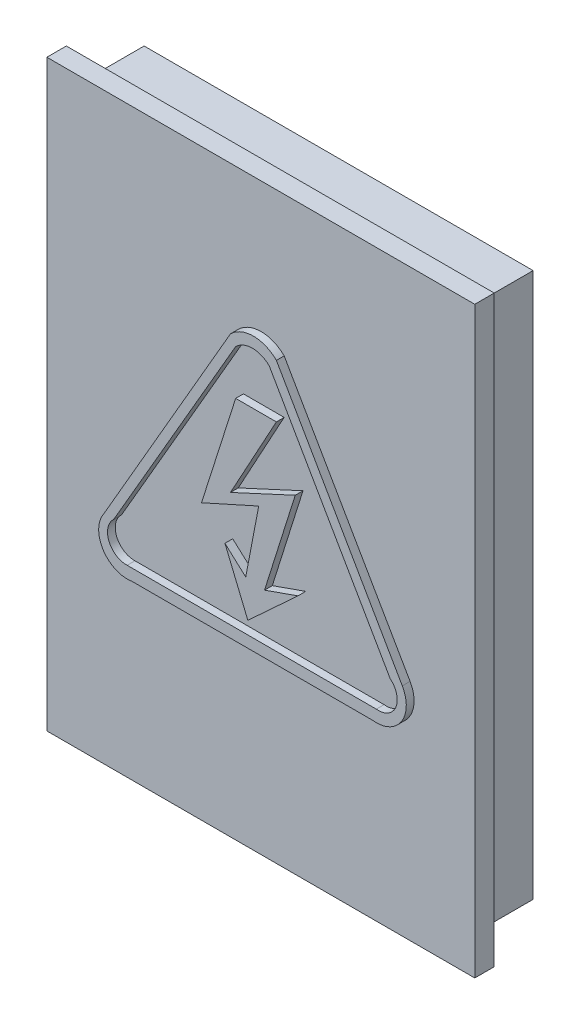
ISO-10303-21;
HEADER;
FILE_DESCRIPTION(('STEP AP214'),'2;1');
FILE_NAME('part.step','',(''),(''),'','','');
FILE_SCHEMA(('AUTOMOTIVE_DESIGN { 1 0 10303 214 1 1 1 1 }'));
ENDSEC;
DATA;
#1=APPLICATION_CONTEXT('core data for automotive mechanical design processes');
#2=APPLICATION_PROTOCOL_DEFINITION('international standard','automotive_design',2000,#1);
#3=PRODUCT_CONTEXT('',#1,'mechanical');
#4=PRODUCT('Part','Part','',(#3));
#5=PRODUCT_RELATED_PRODUCT_CATEGORY('part','',(#4));
#6=PRODUCT_DEFINITION_FORMATION('','',#4);
#7=PRODUCT_DEFINITION_CONTEXT('part definition',#1,'design');
#8=PRODUCT_DEFINITION('design','',#6,#7);
#9=PRODUCT_DEFINITION_SHAPE('','',#8);
#10=(LENGTH_UNIT() NAMED_UNIT(*) SI_UNIT(.MILLI.,.METRE.));
#11=(NAMED_UNIT(*) PLANE_ANGLE_UNIT() SI_UNIT($,.RADIAN.));
#12=(NAMED_UNIT(*) SI_UNIT($,.STERADIAN.) SOLID_ANGLE_UNIT());
#13=UNCERTAINTY_MEASURE_WITH_UNIT(LENGTH_MEASURE(1.E-05),#10,'distance_accuracy_value','');
#14=(GEOMETRIC_REPRESENTATION_CONTEXT(3) GLOBAL_UNCERTAINTY_ASSIGNED_CONTEXT((#13)) GLOBAL_UNIT_ASSIGNED_CONTEXT((#10,
#11,#12)) REPRESENTATION_CONTEXT('',''));
#15=CARTESIAN_POINT('',(0.,0.,0.));
#16=DIRECTION('',(0.,0.,1.));
#17=DIRECTION('',(1.,0.,0.));
#18=AXIS2_PLACEMENT_3D('',#15,#16,#17);
#19=CARTESIAN_POINT('',(0.,0.,20.));
#20=DIRECTION('',(0.,0.,1.));
#21=DIRECTION('',(1.,0.,0.));
#22=AXIS2_PLACEMENT_3D('',#19,#20,#21);
#23=PLANE('',#22);
#24=DIRECTION('',(0.,1.,0.));
#25=VECTOR('',#24,1.);
#26=CARTESIAN_POINT('',(55.,75.,20.));
#27=LINE('',#26,#25);
#28=CARTESIAN_POINT('',(55.,-75.,20.));
#29=VERTEX_POINT('',#28);
#30=CARTESIAN_POINT('',(55.,75.,20.));
#31=VERTEX_POINT('',#30);
#32=EDGE_CURVE('E487',#29,#31,#27,.T.);
#33=ORIENTED_EDGE('',*,*,#32,.T.);
#34=DIRECTION('',(-1.,0.,0.));
#35=VECTOR('',#34,1.);
#36=CARTESIAN_POINT('',(-55.,75.,20.));
#37=LINE('',#36,#35);
#38=CARTESIAN_POINT('',(-55.,75.,20.));
#39=VERTEX_POINT('',#38);
#40=EDGE_CURVE('E490',#31,#39,#37,.T.);
#41=ORIENTED_EDGE('',*,*,#40,.T.);
#42=DIRECTION('',(0.,-1.,0.));
#43=VECTOR('',#42,1.);
#44=CARTESIAN_POINT('',(-55.,75.,20.));
#45=LINE('',#44,#43);
#46=CARTESIAN_POINT('',(-55.,-75.,20.));
#47=VERTEX_POINT('',#46);
#48=EDGE_CURVE('E493',#39,#47,#45,.T.);
#49=ORIENTED_EDGE('',*,*,#48,.T.);
#50=DIRECTION('',(1.,0.,0.));
#51=VECTOR('',#50,1.);
#52=CARTESIAN_POINT('',(-55.,-75.,20.));
#53=LINE('',#52,#51);
#54=EDGE_CURVE('E495',#47,#29,#53,.T.);
#55=ORIENTED_EDGE('',*,*,#54,.T.);
#56=EDGE_LOOP('',(#33,#41,#49,#55));
#57=FACE_BOUND('',#56,.T.);
#58=CARTESIAN_POINT('',(0.0994994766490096,33.1119752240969,20.));
#59=DIRECTION('',(0.,0.,1.));
#60=DIRECTION('',(1.,0.,0.));
#61=AXIS2_PLACEMENT_3D('',#58,#59,#60);
#62=CIRCLE('',#61,8.34537360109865);
#63=CARTESIAN_POINT('',(-5.80157297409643,39.0130433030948,20.));
#64=VERTEX_POINT('',#63);
#65=CARTESIAN_POINT('',(6.00056755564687,39.0130476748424,20.));
#66=VERTEX_POINT('',#65);
#67=EDGE_CURVE('E301',#64,#66,#62,.F.);
#68=ORIENTED_EDGE('',*,*,#67,.T.);
#69=DIRECTION('',(0.498504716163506,-0.866886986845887,0.));
#70=VECTOR('',#69,1.);
#71=CARTESIAN_POINT('',(21.3687661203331,12.2881423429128,20.));
#72=LINE('',#71,#70);
#73=CARTESIAN_POINT('',(38.3710118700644,-17.2783293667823,20.));
#74=VERTEX_POINT('',#73);
#75=EDGE_CURVE('E353',#66,#74,#72,.T.);
#76=ORIENTED_EDGE('',*,*,#75,.T.);
#77=CARTESIAN_POINT('',(31.6924673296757,-21.118836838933,20.));
#78=DIRECTION('',(0.,0.,1.));
#79=DIRECTION('',(1.,0.,0.));
#80=AXIS2_PLACEMENT_3D('',#77,#78,#79);
#81=CIRCLE('',#80,7.70405444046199);
#82=CARTESIAN_POINT('',(30.6346996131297,-28.7499299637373,20.));
#83=VERTEX_POINT('',#82);
#84=EDGE_CURVE('E350',#83,#74,#81,.T.);
#85=ORIENTED_EDGE('',*,*,#84,.F.);
#86=DIRECTION('',(1.,0.,0.));
#87=VECTOR('',#86,1.);
#88=CARTESIAN_POINT('',(0.,-28.7499299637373,20.));
#89=LINE('',#88,#87);
#90=CARTESIAN_POINT('',(-31.161330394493,-28.7499299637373,20.));
#91=VERTEX_POINT('',#90);
#92=EDGE_CURVE('E347',#91,#83,#89,.T.);
#93=ORIENTED_EDGE('',*,*,#92,.F.);
#94=CARTESIAN_POINT('',(-32.3633239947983,-21.5227344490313,20.));
#95=DIRECTION('',(0.,0.,1.));
#96=DIRECTION('',(1.,0.,0.));
#97=AXIS2_PLACEMENT_3D('',#94,#95,#96);
#98=CIRCLE('',#97,7.32646870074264);
#99=CARTESIAN_POINT('',(-38.3422575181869,-17.2884107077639,20.));
#100=VERTEX_POINT('',#99);
#101=EDGE_CURVE('E113',#91,#100,#98,.F.);
#102=ORIENTED_EDGE('',*,*,#101,.T.);
#103=DIRECTION('',(0.500403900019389,0.86579208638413,0.));
#104=VECTOR('',#103,1.);
#105=CARTESIAN_POINT('',(-21.2510702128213,12.2825313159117,20.));
#106=LINE('',#105,#104);
#107=EDGE_CURVE('E108',#100,#64,#106,.T.);
#108=ORIENTED_EDGE('',*,*,#107,.T.);
#109=EDGE_LOOP('',(#68,#76,#85,#93,#102,#108));
#110=FACE_BOUND('',#109,.T.);
#111=ADVANCED_FACE('F93',(#57,#110),#23,.T.);
#112=CARTESIAN_POINT('',(50.,70.,15.));
#113=DIRECTION('',(-1.,0.,0.));
#114=DIRECTION('',(0.,-1.,0.));
#115=AXIS2_PLACEMENT_3D('',#112,#113,#114);
#116=PLANE('',#115);
#117=DIRECTION('',(0.,1.,0.));
#118=VECTOR('',#117,1.);
#119=CARTESIAN_POINT('',(50.,70.,0.));
#120=LINE('',#119,#118);
#121=CARTESIAN_POINT('',(50.,-70.,0.));
#122=VERTEX_POINT('',#121);
#123=CARTESIAN_POINT('',(50.,70.,0.));
#124=VERTEX_POINT('',#123);
#125=EDGE_CURVE('E516',#122,#124,#120,.T.);
#126=ORIENTED_EDGE('',*,*,#125,.T.);
#127=DIRECTION('',(0.,0.,-1.));
#128=VECTOR('',#127,1.);
#129=CARTESIAN_POINT('',(50.,70.,15.));
#130=LINE('',#129,#128);
#131=CARTESIAN_POINT('',(50.,70.,15.));
#132=VERTEX_POINT('',#131);
#133=EDGE_CURVE('E12',#132,#124,#130,.T.);
#134=ORIENTED_EDGE('',*,*,#133,.F.);
#135=DIRECTION('',(0.,1.,0.));
#136=VECTOR('',#135,1.);
#137=CARTESIAN_POINT('',(50.,70.,15.));
#138=LINE('',#137,#136);
#139=CARTESIAN_POINT('',(50.,-70.,15.));
#140=VERTEX_POINT('',#139);
#141=EDGE_CURVE('E517',#140,#132,#138,.T.);
#142=ORIENTED_EDGE('',*,*,#141,.F.);
#143=DIRECTION('',(0.,0.,-1.));
#144=VECTOR('',#143,1.);
#145=CARTESIAN_POINT('',(50.,-70.,15.));
#146=LINE('',#145,#144);
#147=EDGE_CURVE('E530',#140,#122,#146,.T.);
#148=ORIENTED_EDGE('',*,*,#147,.T.);
#149=EDGE_LOOP('',(#126,#134,#142,#148));
#150=FACE_BOUND('',#149,.T.);
#151=ADVANCED_FACE('F95',(#150),#116,.F.);
#152=CARTESIAN_POINT('',(-50.,70.,15.));
#153=DIRECTION('',(0.,-1.,0.));
#154=DIRECTION('',(0.,0.,-1.));
#155=AXIS2_PLACEMENT_3D('',#152,#153,#154);
#156=PLANE('',#155);
#157=DIRECTION('',(-1.,0.,0.));
#158=VECTOR('',#157,1.);
#159=CARTESIAN_POINT('',(-50.,70.,0.));
#160=LINE('',#159,#158);
#161=CARTESIAN_POINT('',(-50.,70.,0.));
#162=VERTEX_POINT('',#161);
#163=EDGE_CURVE('E533',#124,#162,#160,.T.);
#164=ORIENTED_EDGE('',*,*,#163,.T.);
#165=DIRECTION('',(0.,0.,-1.));
#166=VECTOR('',#165,1.);
#167=CARTESIAN_POINT('',(-50.,70.,15.));
#168=LINE('',#167,#166);
#169=CARTESIAN_POINT('',(-50.,70.,15.));
#170=VERTEX_POINT('',#169);
#171=EDGE_CURVE('E101',#170,#162,#168,.T.);
#172=ORIENTED_EDGE('',*,*,#171,.F.);
#173=DIRECTION('',(-1.,0.,0.));
#174=VECTOR('',#173,1.);
#175=CARTESIAN_POINT('',(-50.,70.,15.));
#176=LINE('',#175,#174);
#177=EDGE_CURVE('E520',#132,#170,#176,.T.);
#178=ORIENTED_EDGE('',*,*,#177,.F.);
#179=ORIENTED_EDGE('',*,*,#133,.T.);
#180=EDGE_LOOP('',(#164,#172,#178,#179));
#181=FACE_BOUND('',#180,.T.);
#182=ADVANCED_FACE('F560',(#181),#156,.F.);
#183=CARTESIAN_POINT('',(-50.,70.,15.));
#184=DIRECTION('',(1.,0.,0.));
#185=DIRECTION('',(0.,1.,0.));
#186=AXIS2_PLACEMENT_3D('',#183,#184,#185);
#187=PLANE('',#186);
#188=DIRECTION('',(0.,-1.,0.));
#189=VECTOR('',#188,1.);
#190=CARTESIAN_POINT('',(-50.,70.,0.));
#191=LINE('',#190,#189);
#192=CARTESIAN_POINT('',(-50.,-70.,0.));
#193=VERTEX_POINT('',#192);
#194=EDGE_CURVE('E535',#162,#193,#191,.T.);
#195=ORIENTED_EDGE('',*,*,#194,.T.);
#196=DIRECTION('',(0.,0.,-1.));
#197=VECTOR('',#196,1.);
#198=CARTESIAN_POINT('',(-50.,-70.,15.));
#199=LINE('',#198,#197);
#200=CARTESIAN_POINT('',(-50.,-70.,15.));
#201=VERTEX_POINT('',#200);
#202=EDGE_CURVE('E540',#201,#193,#199,.T.);
#203=ORIENTED_EDGE('',*,*,#202,.F.);
#204=DIRECTION('',(0.,-1.,0.));
#205=VECTOR('',#204,1.);
#206=CARTESIAN_POINT('',(-50.,70.,15.));
#207=LINE('',#206,#205);
#208=EDGE_CURVE('E524',#170,#201,#207,.T.);
#209=ORIENTED_EDGE('',*,*,#208,.F.);
#210=ORIENTED_EDGE('',*,*,#171,.T.);
#211=EDGE_LOOP('',(#195,#203,#209,#210));
#212=FACE_BOUND('',#211,.T.);
#213=ADVANCED_FACE('F546',(#212),#187,.F.);
#214=CARTESIAN_POINT('',(-50.,-70.,15.));
#215=DIRECTION('',(0.,1.,0.));
#216=DIRECTION('',(0.,0.,1.));
#217=AXIS2_PLACEMENT_3D('',#214,#215,#216);
#218=PLANE('',#217);
#219=DIRECTION('',(1.,0.,0.));
#220=VECTOR('',#219,1.);
#221=CARTESIAN_POINT('',(-50.,-70.,0.));
#222=LINE('',#221,#220);
#223=EDGE_CURVE('E521',#193,#122,#222,.T.);
#224=ORIENTED_EDGE('',*,*,#223,.T.);
#225=ORIENTED_EDGE('',*,*,#147,.F.);
#226=DIRECTION('',(1.,0.,0.));
#227=VECTOR('',#226,1.);
#228=CARTESIAN_POINT('',(-50.,-70.,15.));
#229=LINE('',#228,#227);
#230=EDGE_CURVE('E527',#201,#140,#229,.T.);
#231=ORIENTED_EDGE('',*,*,#230,.F.);
#232=ORIENTED_EDGE('',*,*,#202,.T.);
#233=EDGE_LOOP('',(#224,#225,#231,#232));
#234=FACE_BOUND('',#233,.T.);
#235=ADVANCED_FACE('F554',(#234),#218,.F.);
#236=CARTESIAN_POINT('',(0.,0.,0.));
#237=DIRECTION('',(0.,0.,1.));
#238=DIRECTION('',(1.,0.,0.));
#239=AXIS2_PLACEMENT_3D('',#236,#237,#238);
#240=PLANE('',#239);
#241=ORIENTED_EDGE('',*,*,#125,.F.);
#242=ORIENTED_EDGE('',*,*,#223,.F.);
#243=ORIENTED_EDGE('',*,*,#194,.F.);
#244=ORIENTED_EDGE('',*,*,#163,.F.);
#245=EDGE_LOOP('',(#241,#242,#243,#244));
#246=FACE_BOUND('',#245,.T.);
#247=ADVANCED_FACE('F551',(#246),#240,.F.);
#248=CARTESIAN_POINT('',(0.,0.,15.));
#249=DIRECTION('',(0.,0.,1.));
#250=DIRECTION('',(1.,0.,0.));
#251=AXIS2_PLACEMENT_3D('',#248,#249,#250);
#252=PLANE('',#251);
#253=DIRECTION('',(0.,1.,0.));
#254=VECTOR('',#253,1.);
#255=CARTESIAN_POINT('',(55.,75.,15.));
#256=LINE('',#255,#254);
#257=CARTESIAN_POINT('',(55.,-75.,15.));
#258=VERTEX_POINT('',#257);
#259=CARTESIAN_POINT('',(55.,75.,15.));
#260=VERTEX_POINT('',#259);
#261=EDGE_CURVE('E486',#258,#260,#256,.T.);
#262=ORIENTED_EDGE('',*,*,#261,.F.);
#263=DIRECTION('',(1.,0.,0.));
#264=VECTOR('',#263,1.);
#265=CARTESIAN_POINT('',(-55.,-75.,15.));
#266=LINE('',#265,#264);
#267=CARTESIAN_POINT('',(-55.,-75.,15.));
#268=VERTEX_POINT('',#267);
#269=EDGE_CURVE('E491',#268,#258,#266,.T.);
#270=ORIENTED_EDGE('',*,*,#269,.F.);
#271=DIRECTION('',(0.,-1.,0.));
#272=VECTOR('',#271,1.);
#273=CARTESIAN_POINT('',(-55.,75.,15.));
#274=LINE('',#273,#272);
#275=CARTESIAN_POINT('',(-55.,75.,15.));
#276=VERTEX_POINT('',#275);
#277=EDGE_CURVE('E502',#276,#268,#274,.T.);
#278=ORIENTED_EDGE('',*,*,#277,.F.);
#279=DIRECTION('',(-1.,0.,0.));
#280=VECTOR('',#279,1.);
#281=CARTESIAN_POINT('',(-55.,75.,15.));
#282=LINE('',#281,#280);
#283=EDGE_CURVE('E500',#260,#276,#282,.T.);
#284=ORIENTED_EDGE('',*,*,#283,.F.);
#285=EDGE_LOOP('',(#262,#270,#278,#284));
#286=FACE_BOUND('',#285,.T.);
#287=ORIENTED_EDGE('',*,*,#230,.T.);
#288=ORIENTED_EDGE('',*,*,#141,.T.);
#289=ORIENTED_EDGE('',*,*,#177,.T.);
#290=ORIENTED_EDGE('',*,*,#208,.T.);
#291=EDGE_LOOP('',(#287,#288,#289,#290));
#292=FACE_BOUND('',#291,.T.);
#293=ADVANCED_FACE('F559',(#286,#292),#252,.F.);
#294=CARTESIAN_POINT('',(55.,75.,20.));
#295=DIRECTION('',(-1.,0.,0.));
#296=DIRECTION('',(0.,-1.,0.));
#297=AXIS2_PLACEMENT_3D('',#294,#295,#296);
#298=PLANE('',#297);
#299=ORIENTED_EDGE('',*,*,#261,.T.);
#300=DIRECTION('',(0.,0.,-1.));
#301=VECTOR('',#300,1.);
#302=CARTESIAN_POINT('',(55.,75.,20.));
#303=LINE('',#302,#301);
#304=EDGE_CURVE('E513',#31,#260,#303,.T.);
#305=ORIENTED_EDGE('',*,*,#304,.F.);
#306=ORIENTED_EDGE('',*,*,#32,.F.);
#307=DIRECTION('',(0.,0.,-1.));
#308=VECTOR('',#307,1.);
#309=CARTESIAN_POINT('',(55.,-75.,20.));
#310=LINE('',#309,#308);
#311=EDGE_CURVE('E497',#29,#258,#310,.T.);
#312=ORIENTED_EDGE('',*,*,#311,.T.);
#313=EDGE_LOOP('',(#299,#305,#306,#312));
#314=FACE_BOUND('',#313,.T.);
#315=ADVANCED_FACE('F879',(#314),#298,.F.);
#316=CARTESIAN_POINT('',(-55.,75.,20.));
#317=DIRECTION('',(0.,-1.,0.));
#318=DIRECTION('',(0.,0.,-1.));
#319=AXIS2_PLACEMENT_3D('',#316,#317,#318);
#320=PLANE('',#319);
#321=ORIENTED_EDGE('',*,*,#283,.T.);
#322=DIRECTION('',(0.,0.,-1.));
#323=VECTOR('',#322,1.);
#324=CARTESIAN_POINT('',(-55.,75.,20.));
#325=LINE('',#324,#323);
#326=EDGE_CURVE('E510',#39,#276,#325,.T.);
#327=ORIENTED_EDGE('',*,*,#326,.F.);
#328=ORIENTED_EDGE('',*,*,#40,.F.);
#329=ORIENTED_EDGE('',*,*,#304,.T.);
#330=EDGE_LOOP('',(#321,#327,#328,#329));
#331=FACE_BOUND('',#330,.T.);
#332=ADVANCED_FACE('F872',(#331),#320,.F.);
#333=CARTESIAN_POINT('',(-55.,75.,20.));
#334=DIRECTION('',(1.,0.,0.));
#335=DIRECTION('',(0.,1.,0.));
#336=AXIS2_PLACEMENT_3D('',#333,#334,#335);
#337=PLANE('',#336);
#338=ORIENTED_EDGE('',*,*,#277,.T.);
#339=DIRECTION('',(0.,0.,-1.));
#340=VECTOR('',#339,1.);
#341=CARTESIAN_POINT('',(-55.,-75.,20.));
#342=LINE('',#341,#340);
#343=EDGE_CURVE('E507',#47,#268,#342,.T.);
#344=ORIENTED_EDGE('',*,*,#343,.F.);
#345=ORIENTED_EDGE('',*,*,#48,.F.);
#346=ORIENTED_EDGE('',*,*,#326,.T.);
#347=EDGE_LOOP('',(#338,#344,#345,#346));
#348=FACE_BOUND('',#347,.T.);
#349=ADVANCED_FACE('F865',(#348),#337,.F.);
#350=CARTESIAN_POINT('',(-55.,-75.,20.));
#351=DIRECTION('',(0.,1.,0.));
#352=DIRECTION('',(0.,0.,1.));
#353=AXIS2_PLACEMENT_3D('',#350,#351,#352);
#354=PLANE('',#353);
#355=ORIENTED_EDGE('',*,*,#269,.T.);
#356=ORIENTED_EDGE('',*,*,#311,.F.);
#357=ORIENTED_EDGE('',*,*,#54,.F.);
#358=ORIENTED_EDGE('',*,*,#343,.T.);
#359=EDGE_LOOP('',(#355,#356,#357,#358));
#360=FACE_BOUND('',#359,.T.);
#361=ADVANCED_FACE('F706',(#360),#354,.F.);
#362=CARTESIAN_POINT('',(-19.3229230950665,11.1859463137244,22.));
#363=DIRECTION('',(-0.865445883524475,0.501002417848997,0.));
#364=DIRECTION('',(-0.501002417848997,-0.865445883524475,0.));
#365=AXIS2_PLACEMENT_3D('',#362,#363,#364);
#366=PLANE('',#365);
#367=DIRECTION('',(0.501002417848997,0.865445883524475,0.));
#368=VECTOR('',#367,1.);
#369=CARTESIAN_POINT('',(-19.3229230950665,11.1859463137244,20.));
#370=LINE('',#369,#368);
#371=CARTESIAN_POINT('',(-35.8065900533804,-17.2884107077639,20.));
#372=VERTEX_POINT('',#371);
#373=CARTESIAN_POINT('',(-4.46799863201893,36.8467670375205,20.));
#374=VERTEX_POINT('',#373);
#375=EDGE_CURVE('E355',#372,#374,#370,.T.);
#376=ORIENTED_EDGE('',*,*,#375,.T.);
#377=DIRECTION('',(0.,0.,-1.));
#378=VECTOR('',#377,1.);
#379=CARTESIAN_POINT('',(-4.46799863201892,36.8467670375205,22.));
#380=LINE('',#379,#378);
#381=CARTESIAN_POINT('',(-4.46799863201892,36.8467670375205,22.));
#382=VERTEX_POINT('',#381);
#383=EDGE_CURVE('E384',#382,#374,#380,.T.);
#384=ORIENTED_EDGE('',*,*,#383,.F.);
#385=DIRECTION('',(0.501002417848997,0.865445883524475,0.));
#386=VECTOR('',#385,1.);
#387=CARTESIAN_POINT('',(-19.3229230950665,11.1859463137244,22.));
#388=LINE('',#387,#386);
#389=CARTESIAN_POINT('',(-35.8065900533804,-17.2884107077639,22.));
#390=VERTEX_POINT('',#389);
#391=EDGE_CURVE('E328',#390,#382,#388,.T.);
#392=ORIENTED_EDGE('',*,*,#391,.F.);
#393=DIRECTION('',(0.,0.,-1.));
#394=VECTOR('',#393,1.);
#395=CARTESIAN_POINT('',(-35.8065900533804,-17.2884107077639,22.));
#396=LINE('',#395,#394);
#397=EDGE_CURVE('E304',#390,#372,#396,.T.);
#398=ORIENTED_EDGE('',*,*,#397,.T.);
#399=EDGE_LOOP('',(#376,#384,#392,#398));
#400=FACE_BOUND('',#399,.T.);
#401=ADVANCED_FACE('F716',(#400),#366,.F.);
#402=CARTESIAN_POINT('',(-0.148601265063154,32.5273696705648,22.));
#403=DIRECTION('',(0.,0.,-1.));
#404=DIRECTION('',(-1.,0.,0.));
#405=AXIS2_PLACEMENT_3D('',#402,#403,#404);
#406=CYLINDRICAL_SURFACE('',#405,6.1085503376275);
#407=CARTESIAN_POINT('',(-0.148601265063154,32.5273696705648,20.));
#408=DIRECTION('',(0.,0.,1.));
#409=DIRECTION('',(1.,0.,0.));
#410=AXIS2_PLACEMENT_3D('',#407,#408,#409);
#411=CIRCLE('',#410,6.1085503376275);
#412=CARTESIAN_POINT('',(4.17079610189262,36.8467670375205,20.));
#413=VERTEX_POINT('',#412);
#414=EDGE_CURVE('E358',#374,#413,#411,.F.);
#415=ORIENTED_EDGE('',*,*,#414,.T.);
#416=DIRECTION('',(0.,0.,-1.));
#417=VECTOR('',#416,1.);
#418=CARTESIAN_POINT('',(4.17079610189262,36.8467670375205,22.));
#419=LINE('',#418,#417);
#420=CARTESIAN_POINT('',(4.17079610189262,36.8467670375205,22.));
#421=VERTEX_POINT('',#420);
#422=EDGE_CURVE('E381',#421,#413,#419,.T.);
#423=ORIENTED_EDGE('',*,*,#422,.F.);
#424=CARTESIAN_POINT('',(-0.148601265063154,32.5273696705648,22.));
#425=DIRECTION('',(0.,0.,1.));
#426=DIRECTION('',(1.,0.,0.));
#427=AXIS2_PLACEMENT_3D('',#424,#425,#426);
#428=CIRCLE('',#427,6.1085503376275);
#429=EDGE_CURVE('E331',#382,#421,#428,.F.);
#430=ORIENTED_EDGE('',*,*,#429,.F.);
#431=ORIENTED_EDGE('',*,*,#383,.T.);
#432=EDGE_LOOP('',(#415,#423,#430,#431));
#433=FACE_BOUND('',#432,.T.);
#434=ADVANCED_FACE('F721',(#433),#406,.F.);
#435=CARTESIAN_POINT('',(19.0543265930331,10.9517431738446,22.));
#436=DIRECTION('',(0.866994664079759,0.498317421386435,0.));
#437=DIRECTION('',(-0.498317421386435,0.866994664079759,0.));
#438=AXIS2_PLACEMENT_3D('',#435,#436,#437);
#439=PLANE('',#438);
#440=DIRECTION('',(0.498317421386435,-0.866994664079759,0.));
#441=VECTOR('',#440,1.);
#442=CARTESIAN_POINT('',(19.0543265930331,10.9517431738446,20.));
#443=LINE('',#442,#441);
#444=CARTESIAN_POINT('',(35.279959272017,-17.2783293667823,20.));
#445=VERTEX_POINT('',#444);
#446=EDGE_CURVE('E361',#413,#445,#443,.T.);
#447=ORIENTED_EDGE('',*,*,#446,.T.);
#448=DIRECTION('',(0.,0.,-1.));
#449=VECTOR('',#448,1.);
#450=CARTESIAN_POINT('',(35.279959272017,-17.2783293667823,22.));
#451=LINE('',#450,#449);
#452=CARTESIAN_POINT('',(35.279959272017,-17.2783293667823,22.));
#453=VERTEX_POINT('',#452);
#454=EDGE_CURVE('E378',#453,#445,#451,.T.);
#455=ORIENTED_EDGE('',*,*,#454,.F.);
#456=DIRECTION('',(0.498317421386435,-0.866994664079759,0.));
#457=VECTOR('',#456,1.);
#458=CARTESIAN_POINT('',(19.0543265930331,10.9517431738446,22.));
#459=LINE('',#458,#457);
#460=EDGE_CURVE('E333',#421,#453,#459,.T.);
#461=ORIENTED_EDGE('',*,*,#460,.F.);
#462=ORIENTED_EDGE('',*,*,#422,.T.);
#463=EDGE_LOOP('',(#447,#455,#461,#462));
#464=FACE_BOUND('',#463,.T.);
#465=ADVANCED_FACE('F730',(#464),#439,.F.);
#466=CARTESIAN_POINT('',(32.2622959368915,-21.0204703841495,22.));
#467=DIRECTION('',(0.,0.,-1.));
#468=DIRECTION('',(-1.,0.,0.));
#469=AXIS2_PLACEMENT_3D('',#466,#467,#468);
#470=CYLINDRICAL_SURFACE('',#469,4.80727692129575);
#471=CARTESIAN_POINT('',(32.2622959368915,-21.0204703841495,20.));
#472=DIRECTION('',(0.,0.,1.));
#473=DIRECTION('',(1.,0.,0.));
#474=AXIS2_PLACEMENT_3D('',#471,#472,#473);
#475=CIRCLE('',#474,4.80727692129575);
#476=CARTESIAN_POINT('',(31.6924673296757,-25.7938556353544,20.));
#477=VERTEX_POINT('',#476);
#478=EDGE_CURVE('E364',#445,#477,#475,.F.);
#479=ORIENTED_EDGE('',*,*,#478,.T.);
#480=DIRECTION('',(0.,0.,-1.));
#481=VECTOR('',#480,1.);
#482=CARTESIAN_POINT('',(31.6924673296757,-25.7938556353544,22.));
#483=LINE('',#482,#481);
#484=CARTESIAN_POINT('',(31.6924673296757,-25.7938556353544,22.));
#485=VERTEX_POINT('',#484);
#486=EDGE_CURVE('E375',#485,#477,#483,.T.);
#487=ORIENTED_EDGE('',*,*,#486,.F.);
#488=CARTESIAN_POINT('',(32.2622959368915,-21.0204703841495,22.));
#489=DIRECTION('',(0.,0.,1.));
#490=DIRECTION('',(1.,0.,0.));
#491=AXIS2_PLACEMENT_3D('',#488,#489,#490);
#492=CIRCLE('',#491,4.80727692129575);
#493=EDGE_CURVE('E335',#453,#485,#492,.F.);
#494=ORIENTED_EDGE('',*,*,#493,.F.);
#495=ORIENTED_EDGE('',*,*,#454,.T.);
#496=EDGE_LOOP('',(#479,#487,#494,#495));
#497=FACE_BOUND('',#496,.T.);
#498=ADVANCED_FACE('F739',(#497),#470,.F.);
#499=CARTESIAN_POINT('',(0.,-25.7938556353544,22.));
#500=DIRECTION('',(0.,1.,0.));
#501=DIRECTION('',(0.,0.,1.));
#502=AXIS2_PLACEMENT_3D('',#499,#500,#501);
#503=PLANE('',#502);
#504=DIRECTION('',(1.,0.,0.));
#505=VECTOR('',#504,1.);
#506=CARTESIAN_POINT('',(0.,-25.7938556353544,20.));
#507=LINE('',#506,#505);
#508=CARTESIAN_POINT('',(-32.3633239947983,-25.7938556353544,20.));
#509=VERTEX_POINT('',#508);
#510=EDGE_CURVE('E367',#509,#477,#507,.T.);
#511=ORIENTED_EDGE('',*,*,#510,.F.);
#512=DIRECTION('',(0.,0.,-1.));
#513=VECTOR('',#512,1.);
#514=CARTESIAN_POINT('',(-32.3633239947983,-25.7938556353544,22.));
#515=LINE('',#514,#513);
#516=CARTESIAN_POINT('',(-32.3633239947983,-25.7938556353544,22.));
#517=VERTEX_POINT('',#516);
#518=EDGE_CURVE('E372',#517,#509,#515,.T.);
#519=ORIENTED_EDGE('',*,*,#518,.F.);
#520=DIRECTION('',(1.,0.,0.));
#521=VECTOR('',#520,1.);
#522=CARTESIAN_POINT('',(0.,-25.7938556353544,22.));
#523=LINE('',#522,#521);
#524=EDGE_CURVE('E337',#517,#485,#523,.T.);
#525=ORIENTED_EDGE('',*,*,#524,.T.);
#526=ORIENTED_EDGE('',*,*,#486,.T.);
#527=EDGE_LOOP('',(#511,#519,#525,#526));
#528=FACE_BOUND('',#527,.T.);
#529=ADVANCED_FACE('F748',(#528),#503,.T.);
#530=CARTESIAN_POINT('',(0.0994994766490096,33.1119752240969,22.));
#531=DIRECTION('',(0.,0.,-1.));
#532=DIRECTION('',(-1.,0.,0.));
#533=AXIS2_PLACEMENT_3D('',#530,#531,#532);
#534=CYLINDRICAL_SURFACE('',#533,8.34537360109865);
#535=ORIENTED_EDGE('',*,*,#67,.F.);
#536=DIRECTION('',(0.,0.,-1.));
#537=VECTOR('',#536,1.);
#538=CARTESIAN_POINT('',(-5.80157297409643,39.0130433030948,22.));
#539=LINE('',#538,#537);
#540=CARTESIAN_POINT('',(-5.80157297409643,39.0130433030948,22.));
#541=VERTEX_POINT('',#540);
#542=EDGE_CURVE('E295',#541,#64,#539,.T.);
#543=ORIENTED_EDGE('',*,*,#542,.F.);
#544=CARTESIAN_POINT('',(0.0994994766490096,33.1119752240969,22.));
#545=DIRECTION('',(0.,0.,1.));
#546=DIRECTION('',(1.,0.,0.));
#547=AXIS2_PLACEMENT_3D('',#544,#545,#546);
#548=CIRCLE('',#547,8.34537360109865);
#549=CARTESIAN_POINT('',(6.00056755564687,39.0130476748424,22.));
#550=VERTEX_POINT('',#549);
#551=EDGE_CURVE('E299',#541,#550,#548,.F.);
#552=ORIENTED_EDGE('',*,*,#551,.T.);
#553=DIRECTION('',(0.,0.,-1.));
#554=VECTOR('',#553,1.);
#555=CARTESIAN_POINT('',(6.00056755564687,39.0130476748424,22.));
#556=LINE('',#555,#554);
#557=EDGE_CURVE('E343',#550,#66,#556,.T.);
#558=ORIENTED_EDGE('',*,*,#557,.T.);
#559=EDGE_LOOP('',(#535,#543,#552,#558));
#560=FACE_BOUND('',#559,.T.);
#561=ADVANCED_FACE('F297',(#560),#534,.T.);
#562=CARTESIAN_POINT('',(-21.2510702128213,12.2825313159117,22.));
#563=DIRECTION('',(-0.86579208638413,0.500403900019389,0.));
#564=DIRECTION('',(-0.500403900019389,-0.86579208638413,0.));
#565=AXIS2_PLACEMENT_3D('',#562,#563,#564);
#566=PLANE('',#565);
#567=ORIENTED_EDGE('',*,*,#107,.F.);
#568=DIRECTION('',(0.,0.,-1.));
#569=VECTOR('',#568,1.);
#570=CARTESIAN_POINT('',(-38.3422575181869,-17.2884107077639,22.));
#571=LINE('',#570,#569);
#572=CARTESIAN_POINT('',(-38.3422575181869,-17.2884107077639,22.));
#573=VERTEX_POINT('',#572);
#574=EDGE_CURVE('E305',#573,#100,#571,.T.);
#575=ORIENTED_EDGE('',*,*,#574,.F.);
#576=DIRECTION('',(0.500403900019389,0.86579208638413,0.));
#577=VECTOR('',#576,1.);
#578=CARTESIAN_POINT('',(-21.2510702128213,12.2825313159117,22.));
#579=LINE('',#578,#577);
#580=EDGE_CURVE('E312',#573,#541,#579,.T.);
#581=ORIENTED_EDGE('',*,*,#580,.T.);
#582=ORIENTED_EDGE('',*,*,#542,.T.);
#583=EDGE_LOOP('',(#567,#575,#581,#582));
#584=FACE_BOUND('',#583,.T.);
#585=ADVANCED_FACE('F318',(#584),#566,.T.);
#586=CARTESIAN_POINT('',(-32.3633239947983,-21.5227344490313,22.));
#587=DIRECTION('',(0.,0.,-1.));
#588=DIRECTION('',(-1.,0.,0.));
#589=AXIS2_PLACEMENT_3D('',#586,#587,#588);
#590=CYLINDRICAL_SURFACE('',#589,7.32646870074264);
#591=ORIENTED_EDGE('',*,*,#101,.F.);
#592=DIRECTION('',(0.,0.,-1.));
#593=VECTOR('',#592,1.);
#594=CARTESIAN_POINT('',(-31.161330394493,-28.7499299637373,22.));
#595=LINE('',#594,#593);
#596=CARTESIAN_POINT('',(-31.161330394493,-28.7499299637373,22.));
#597=VERTEX_POINT('',#596);
#598=EDGE_CURVE('E395',#597,#91,#595,.T.);
#599=ORIENTED_EDGE('',*,*,#598,.F.);
#600=CARTESIAN_POINT('',(-32.3633239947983,-21.5227344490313,22.));
#601=DIRECTION('',(0.,0.,1.));
#602=DIRECTION('',(1.,0.,0.));
#603=AXIS2_PLACEMENT_3D('',#600,#601,#602);
#604=CIRCLE('',#603,7.32646870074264);
#605=EDGE_CURVE('E319',#597,#573,#604,.F.);
#606=ORIENTED_EDGE('',*,*,#605,.T.);
#607=ORIENTED_EDGE('',*,*,#574,.T.);
#608=EDGE_LOOP('',(#591,#599,#606,#607));
#609=FACE_BOUND('',#608,.T.);
#610=ADVANCED_FACE('F771',(#609),#590,.T.);
#611=CARTESIAN_POINT('',(0.,-28.7499299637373,22.));
#612=DIRECTION('',(0.,1.,0.));
#613=DIRECTION('',(0.,0.,1.));
#614=AXIS2_PLACEMENT_3D('',#611,#612,#613);
#615=PLANE('',#614);
#616=ORIENTED_EDGE('',*,*,#92,.T.);
#617=DIRECTION('',(0.,0.,-1.));
#618=VECTOR('',#617,1.);
#619=CARTESIAN_POINT('',(30.6346996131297,-28.7499299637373,22.));
#620=LINE('',#619,#618);
#621=CARTESIAN_POINT('',(30.6346996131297,-28.7499299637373,22.));
#622=VERTEX_POINT('',#621);
#623=EDGE_CURVE('E392',#622,#83,#620,.T.);
#624=ORIENTED_EDGE('',*,*,#623,.F.);
#625=DIRECTION('',(1.,0.,0.));
#626=VECTOR('',#625,1.);
#627=CARTESIAN_POINT('',(0.,-28.7499299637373,22.));
#628=LINE('',#627,#626);
#629=EDGE_CURVE('E321',#597,#622,#628,.T.);
#630=ORIENTED_EDGE('',*,*,#629,.F.);
#631=ORIENTED_EDGE('',*,*,#598,.T.);
#632=EDGE_LOOP('',(#616,#624,#630,#631));
#633=FACE_BOUND('',#632,.T.);
#634=ADVANCED_FACE('F778',(#633),#615,.F.);
#635=CARTESIAN_POINT('',(31.6924673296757,-21.118836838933,22.));
#636=DIRECTION('',(0.,0.,-1.));
#637=DIRECTION('',(-1.,0.,0.));
#638=AXIS2_PLACEMENT_3D('',#635,#636,#637);
#639=CYLINDRICAL_SURFACE('',#638,7.70405444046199);
#640=ORIENTED_EDGE('',*,*,#84,.T.);
#641=DIRECTION('',(0.,0.,-1.));
#642=VECTOR('',#641,1.);
#643=CARTESIAN_POINT('',(38.3710118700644,-17.2783293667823,22.));
#644=LINE('',#643,#642);
#645=CARTESIAN_POINT('',(38.3710118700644,-17.2783293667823,22.));
#646=VERTEX_POINT('',#645);
#647=EDGE_CURVE('E389',#646,#74,#644,.T.);
#648=ORIENTED_EDGE('',*,*,#647,.F.);
#649=CARTESIAN_POINT('',(31.6924673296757,-21.118836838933,22.));
#650=DIRECTION('',(0.,0.,1.));
#651=DIRECTION('',(1.,0.,0.));
#652=AXIS2_PLACEMENT_3D('',#649,#650,#651);
#653=CIRCLE('',#652,7.70405444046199);
#654=EDGE_CURVE('E325',#622,#646,#653,.T.);
#655=ORIENTED_EDGE('',*,*,#654,.F.);
#656=ORIENTED_EDGE('',*,*,#623,.T.);
#657=EDGE_LOOP('',(#640,#648,#655,#656));
#658=FACE_BOUND('',#657,.T.);
#659=ADVANCED_FACE('F787',(#658),#639,.T.);
#660=CARTESIAN_POINT('',(21.3687661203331,12.2881423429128,22.));
#661=DIRECTION('',(0.866886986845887,0.498504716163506,0.));
#662=DIRECTION('',(-0.498504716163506,0.866886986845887,0.));
#663=AXIS2_PLACEMENT_3D('',#660,#661,#662);
#664=PLANE('',#663);
#665=ORIENTED_EDGE('',*,*,#75,.F.);
#666=ORIENTED_EDGE('',*,*,#557,.F.);
#667=DIRECTION('',(0.498504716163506,-0.866886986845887,0.));
#668=VECTOR('',#667,1.);
#669=CARTESIAN_POINT('',(21.3687661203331,12.2881423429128,22.));
#670=LINE('',#669,#668);
#671=EDGE_CURVE('E315',#550,#646,#670,.T.);
#672=ORIENTED_EDGE('',*,*,#671,.T.);
#673=ORIENTED_EDGE('',*,*,#647,.T.);
#674=EDGE_LOOP('',(#665,#666,#672,#673));
#675=FACE_BOUND('',#674,.T.);
#676=ADVANCED_FACE('F796',(#675),#664,.T.);
#677=CARTESIAN_POINT('',(-32.5354893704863,-20.9138609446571,22.));
#678=DIRECTION('',(0.,0.,-1.));
#679=DIRECTION('',(-1.,0.,0.));
#680=AXIS2_PLACEMENT_3D('',#677,#678,#679);
#681=CYLINDRICAL_SURFACE('',#680,4.88303072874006);
#682=CARTESIAN_POINT('',(-32.5354893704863,-20.9138609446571,20.));
#683=DIRECTION('',(0.,0.,1.));
#684=DIRECTION('',(1.,0.,0.));
#685=AXIS2_PLACEMENT_3D('',#682,#683,#684);
#686=CIRCLE('',#685,4.88303072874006);
#687=EDGE_CURVE('E316',#372,#509,#686,.T.);
#688=ORIENTED_EDGE('',*,*,#687,.F.);
#689=ORIENTED_EDGE('',*,*,#397,.F.);
#690=CARTESIAN_POINT('',(-32.5354893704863,-20.9138609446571,22.));
#691=DIRECTION('',(0.,0.,1.));
#692=DIRECTION('',(1.,0.,0.));
#693=AXIS2_PLACEMENT_3D('',#690,#691,#692);
#694=CIRCLE('',#693,4.88303072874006);
#695=EDGE_CURVE('E340',#390,#517,#694,.T.);
#696=ORIENTED_EDGE('',*,*,#695,.T.);
#697=ORIENTED_EDGE('',*,*,#518,.T.);
#698=EDGE_LOOP('',(#688,#689,#696,#697));
#699=FACE_BOUND('',#698,.T.);
#700=ADVANCED_FACE('F634',(#699),#681,.F.);
#701=CARTESIAN_POINT('',(0.,0.,22.));
#702=DIRECTION('',(0.,0.,1.));
#703=DIRECTION('',(1.,0.,0.));
#704=AXIS2_PLACEMENT_3D('',#701,#702,#703);
#705=PLANE('',#704);
#706=ORIENTED_EDGE('',*,*,#551,.F.);
#707=ORIENTED_EDGE('',*,*,#580,.F.);
#708=ORIENTED_EDGE('',*,*,#605,.F.);
#709=ORIENTED_EDGE('',*,*,#629,.T.);
#710=ORIENTED_EDGE('',*,*,#654,.T.);
#711=ORIENTED_EDGE('',*,*,#671,.F.);
#712=EDGE_LOOP('',(#706,#707,#708,#709,#710,#711));
#713=FACE_BOUND('',#712,.T.);
#714=ORIENTED_EDGE('',*,*,#391,.T.);
#715=ORIENTED_EDGE('',*,*,#429,.T.);
#716=ORIENTED_EDGE('',*,*,#460,.T.);
#717=ORIENTED_EDGE('',*,*,#493,.T.);
#718=ORIENTED_EDGE('',*,*,#524,.F.);
#719=ORIENTED_EDGE('',*,*,#695,.F.);
#720=EDGE_LOOP('',(#714,#715,#716,#717,#718,#719));
#721=FACE_BOUND('',#720,.T.);
#722=ADVANCED_FACE('F309',(#713,#721),#705,.T.);
#723=CARTESIAN_POINT('',(0.,0.,22.));
#724=DIRECTION('',(0.,0.,1.));
#725=DIRECTION('',(1.,0.,0.));
#726=AXIS2_PLACEMENT_3D('',#723,#724,#725);
#727=PLANE('',#726);
#728=DIRECTION('',(0.302957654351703,0.953004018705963,0.));
#729=VECTOR('',#728,1.);
#730=CARTESIAN_POINT('',(-11.3666629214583,3.61343443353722,22.));
#731=LINE('',#730,#729);
#732=CARTESIAN_POINT('',(-13.2519980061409,-2.31720269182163,22.));
#733=VERTEX_POINT('',#732);
#734=CARTESIAN_POINT('',(-4.46799863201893,25.3143378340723,22.));
#735=VERTEX_POINT('',#734);
#736=EDGE_CURVE('E399',#733,#735,#731,.T.);
#737=ORIENTED_EDGE('',*,*,#736,.F.);
#738=DIRECTION('',(-0.911903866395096,-0.410403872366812,0.));
#739=VECTOR('',#738,1.);
#740=CARTESIAN_POINT('',(-1.36484125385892,3.03263224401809,22.));
#741=LINE('',#740,#739);
#742=CARTESIAN_POINT('',(1.45776786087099,4.302952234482,22.));
#743=VERTEX_POINT('',#742);
#744=EDGE_CURVE('E402',#743,#733,#741,.T.);
#745=ORIENTED_EDGE('',*,*,#744,.F.);
#746=DIRECTION('',(0.187753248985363,0.982216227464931,0.));
#747=VECTOR('',#746,1.);
#748=CARTESIAN_POINT('',(0.612853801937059,-0.117148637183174,22.));
#749=LINE('',#748,#747);
#750=CARTESIAN_POINT('',(-1.88111857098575,-13.164167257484,22.));
#751=VERTEX_POINT('',#750);
#752=EDGE_CURVE('E406',#751,#743,#749,.T.);
#753=ORIENTED_EDGE('',*,*,#752,.F.);
#754=DIRECTION('',(-0.741463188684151,0.670993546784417,0.));
#755=VECTOR('',#754,1.);
#756=CARTESIAN_POINT('',(-7.39633761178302,-8.17312192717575,22.));
#757=LINE('',#756,#755);
#758=CARTESIAN_POINT('',(-7.2266602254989,-8.32667295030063,22.));
#759=VERTEX_POINT('',#758);
#760=EDGE_CURVE('E409',#751,#759,#757,.T.);
#761=ORIENTED_EDGE('',*,*,#760,.T.);
#762=DIRECTION('',(0.382809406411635,-0.92382734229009,0.));
#763=VECTOR('',#762,1.);
#764=CARTESIAN_POINT('',(-9.11236964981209,-3.77592289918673,22.));
#765=LINE('',#764,#763);
#766=CARTESIAN_POINT('',(-1.33860265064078,-22.5362208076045,22.));
#767=VERTEX_POINT('',#766);
#768=EDGE_CURVE('E411',#759,#767,#765,.T.);
#769=ORIENTED_EDGE('',*,*,#768,.T.);
#770=DIRECTION('',(0.734975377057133,0.678093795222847,0.));
#771=VECTOR('',#770,1.);
#772=CARTESIAN_POINT('',(10.6161477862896,-11.5066783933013,22.));
#773=LINE('',#772,#771);
#774=CARTESIAN_POINT('',(11.549002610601,-10.6460195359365,22.));
#775=VERTEX_POINT('',#774);
#776=EDGE_CURVE('E413',#767,#775,#773,.T.);
#777=ORIENTED_EDGE('',*,*,#776,.T.);
#778=DIRECTION('',(-0.943290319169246,-0.331968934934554,0.));
#779=VECTOR('',#778,1.);
#780=CARTESIAN_POINT('',(4.60646642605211,-13.089282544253,22.));
#781=LINE('',#780,#779);
#782=CARTESIAN_POINT('',(2.95304354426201,-13.6711660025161,22.));
#783=VERTEX_POINT('',#782);
#784=EDGE_CURVE('E415',#775,#783,#781,.T.);
#785=ORIENTED_EDGE('',*,*,#784,.T.);
#786=DIRECTION('',(-0.300176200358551,-0.953883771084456,0.));
#787=VECTOR('',#786,1.);
#788=CARTESIAN_POINT('',(6.60146612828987,-2.07740510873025,22.));
#789=LINE('',#788,#787);
#790=CARTESIAN_POINT('',(10.8432250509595,11.4018280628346,22.));
#791=VERTEX_POINT('',#790);
#792=EDGE_CURVE('E417',#791,#783,#789,.T.);
#793=ORIENTED_EDGE('',*,*,#792,.F.);
#794=DIRECTION('',(0.907768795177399,0.419470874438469,0.));
#795=VECTOR('',#794,1.);
#796=CARTESIAN_POINT('',(-2.43368890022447,5.266699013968,22.));
#797=LINE('',#796,#795);
#798=CARTESIAN_POINT('',(-5.80157297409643,3.71043349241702,22.));
#799=VERTEX_POINT('',#798);
#800=EDGE_CURVE('E420',#799,#791,#797,.T.);
#801=ORIENTED_EDGE('',*,*,#800,.F.);
#802=DIRECTION('',(-0.479421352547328,-0.877584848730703,0.));
#803=VECTOR('',#802,1.);
#804=CARTESIAN_POINT('',(-6.02921290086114,3.29373667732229,22.));
#805=LINE('',#804,#803);
#806=CARTESIAN_POINT('',(6.00055995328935,25.3143378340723,22.));
#807=VERTEX_POINT('',#806);
#808=EDGE_CURVE('E423',#807,#799,#805,.T.);
#809=ORIENTED_EDGE('',*,*,#808,.F.);
#810=DIRECTION('',(1.,0.,0.));
#811=VECTOR('',#810,1.);
#812=CARTESIAN_POINT('',(0.,25.3143378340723,22.));
#813=LINE('',#812,#811);
#814=EDGE_CURVE('E426',#735,#807,#813,.T.);
#815=ORIENTED_EDGE('',*,*,#814,.F.);
#816=EDGE_LOOP('',(#737,#745,#753,#761,#769,#777,#785,#793,#801,#809,#815));
#817=FACE_BOUND('',#816,.T.);
#818=ADVANCED_FACE('F626',(#817),#727,.T.);
#819=CARTESIAN_POINT('',(-1.36484125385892,3.03263224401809,22.));
#820=DIRECTION('',(0.410403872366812,-0.911903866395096,0.));
#821=DIRECTION('',(0.911903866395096,0.410403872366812,0.));
#822=AXIS2_PLACEMENT_3D('',#819,#820,#821);
#823=PLANE('',#822);
#824=DIRECTION('',(-0.911903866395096,-0.410403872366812,0.));
#825=VECTOR('',#824,1.);
#826=CARTESIAN_POINT('',(-1.36484125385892,3.03263224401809,20.));
#827=LINE('',#826,#825);
#828=CARTESIAN_POINT('',(1.45776786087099,4.302952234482,20.));
#829=VERTEX_POINT('',#828);
#830=CARTESIAN_POINT('',(-13.2519980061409,-2.31720269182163,20.));
#831=VERTEX_POINT('',#830);
#832=EDGE_CURVE('E431',#829,#831,#827,.T.);
#833=ORIENTED_EDGE('',*,*,#832,.F.);
#834=DIRECTION('',(0.,0.,-1.));
#835=VECTOR('',#834,1.);
#836=CARTESIAN_POINT('',(1.45776786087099,4.302952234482,22.));
#837=LINE('',#836,#835);
#838=EDGE_CURVE('E480',#743,#829,#837,.T.);
#839=ORIENTED_EDGE('',*,*,#838,.F.);
#840=ORIENTED_EDGE('',*,*,#744,.T.);
#841=DIRECTION('',(0.,0.,-1.));
#842=VECTOR('',#841,1.);
#843=CARTESIAN_POINT('',(-13.2519980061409,-2.31720269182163,22.));
#844=LINE('',#843,#842);
#845=EDGE_CURVE('E483',#733,#831,#844,.T.);
#846=ORIENTED_EDGE('',*,*,#845,.T.);
#847=EDGE_LOOP('',(#833,#839,#840,#846));
#848=FACE_BOUND('',#847,.T.);
#849=ADVANCED_FACE('F624',(#848),#823,.T.);
#850=CARTESIAN_POINT('',(0.612853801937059,-0.117148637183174,22.));
#851=DIRECTION('',(-0.982216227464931,0.187753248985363,0.));
#852=DIRECTION('',(-0.187753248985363,-0.982216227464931,0.));
#853=AXIS2_PLACEMENT_3D('',#850,#851,#852);
#854=PLANE('',#853);
#855=DIRECTION('',(0.187753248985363,0.982216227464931,0.));
#856=VECTOR('',#855,1.);
#857=CARTESIAN_POINT('',(0.612853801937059,-0.117148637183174,20.));
#858=LINE('',#857,#856);
#859=CARTESIAN_POINT('',(-1.88111857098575,-13.164167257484,20.));
#860=VERTEX_POINT('',#859);
#861=EDGE_CURVE('E433',#860,#829,#858,.T.);
#862=ORIENTED_EDGE('',*,*,#861,.F.);
#863=DIRECTION('',(0.,0.,-1.));
#864=VECTOR('',#863,1.);
#865=CARTESIAN_POINT('',(-1.88111857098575,-13.164167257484,22.));
#866=LINE('',#865,#864);
#867=EDGE_CURVE('E477',#751,#860,#866,.T.);
#868=ORIENTED_EDGE('',*,*,#867,.F.);
#869=ORIENTED_EDGE('',*,*,#752,.T.);
#870=ORIENTED_EDGE('',*,*,#838,.T.);
#871=EDGE_LOOP('',(#862,#868,#869,#870));
#872=FACE_BOUND('',#871,.T.);
#873=ADVANCED_FACE('F621',(#872),#854,.T.);
#874=CARTESIAN_POINT('',(-7.39633761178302,-8.17312192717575,22.));
#875=DIRECTION('',(-0.670993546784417,-0.741463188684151,0.));
#876=DIRECTION('',(0.741463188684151,-0.670993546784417,0.));
#877=AXIS2_PLACEMENT_3D('',#874,#875,#876);
#878=PLANE('',#877);
#879=DIRECTION('',(-0.741463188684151,0.670993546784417,0.));
#880=VECTOR('',#879,1.);
#881=CARTESIAN_POINT('',(-7.39633761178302,-8.17312192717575,20.));
#882=LINE('',#881,#880);
#883=CARTESIAN_POINT('',(-7.2266602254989,-8.32667295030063,20.));
#884=VERTEX_POINT('',#883);
#885=EDGE_CURVE('E435',#860,#884,#882,.T.);
#886=ORIENTED_EDGE('',*,*,#885,.T.);
#887=DIRECTION('',(0.,0.,-1.));
#888=VECTOR('',#887,1.);
#889=CARTESIAN_POINT('',(-7.2266602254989,-8.32667295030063,22.));
#890=LINE('',#889,#888);
#891=EDGE_CURVE('E474',#759,#884,#890,.T.);
#892=ORIENTED_EDGE('',*,*,#891,.F.);
#893=ORIENTED_EDGE('',*,*,#760,.F.);
#894=ORIENTED_EDGE('',*,*,#867,.T.);
#895=EDGE_LOOP('',(#886,#892,#893,#894));
#896=FACE_BOUND('',#895,.T.);
#897=ADVANCED_FACE('F616',(#896),#878,.F.);
#898=CARTESIAN_POINT('',(-9.11236964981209,-3.77592289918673,22.));
#899=DIRECTION('',(0.92382734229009,0.382809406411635,0.));
#900=DIRECTION('',(-0.382809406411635,0.92382734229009,0.));
#901=AXIS2_PLACEMENT_3D('',#898,#899,#900);
#902=PLANE('',#901);
#903=DIRECTION('',(0.382809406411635,-0.92382734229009,0.));
#904=VECTOR('',#903,1.);
#905=CARTESIAN_POINT('',(-9.11236964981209,-3.77592289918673,20.));
#906=LINE('',#905,#904);
#907=CARTESIAN_POINT('',(-1.33860265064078,-22.5362208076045,20.));
#908=VERTEX_POINT('',#907);
#909=EDGE_CURVE('E438',#884,#908,#906,.T.);
#910=ORIENTED_EDGE('',*,*,#909,.T.);
#911=DIRECTION('',(0.,0.,-1.));
#912=VECTOR('',#911,1.);
#913=CARTESIAN_POINT('',(-1.33860265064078,-22.5362208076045,22.));
#914=LINE('',#913,#912);
#915=EDGE_CURVE('E471',#767,#908,#914,.T.);
#916=ORIENTED_EDGE('',*,*,#915,.F.);
#917=ORIENTED_EDGE('',*,*,#768,.F.);
#918=ORIENTED_EDGE('',*,*,#891,.T.);
#919=EDGE_LOOP('',(#910,#916,#917,#918));
#920=FACE_BOUND('',#919,.T.);
#921=ADVANCED_FACE('F613',(#920),#902,.F.);
#922=CARTESIAN_POINT('',(10.6161477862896,-11.5066783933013,22.));
#923=DIRECTION('',(-0.678093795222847,0.734975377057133,0.));
#924=DIRECTION('',(-0.734975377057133,-0.678093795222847,0.));
#925=AXIS2_PLACEMENT_3D('',#922,#923,#924);
#926=PLANE('',#925);
#927=DIRECTION('',(0.734975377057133,0.678093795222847,0.));
#928=VECTOR('',#927,1.);
#929=CARTESIAN_POINT('',(10.6161477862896,-11.5066783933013,20.));
#930=LINE('',#929,#928);
#931=CARTESIAN_POINT('',(11.549002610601,-10.6460195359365,20.));
#932=VERTEX_POINT('',#931);
#933=EDGE_CURVE('E441',#908,#932,#930,.T.);
#934=ORIENTED_EDGE('',*,*,#933,.T.);
#935=DIRECTION('',(0.,0.,-1.));
#936=VECTOR('',#935,1.);
#937=CARTESIAN_POINT('',(11.549002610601,-10.6460195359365,22.));
#938=LINE('',#937,#936);
#939=EDGE_CURVE('E468',#775,#932,#938,.T.);
#940=ORIENTED_EDGE('',*,*,#939,.F.);
#941=ORIENTED_EDGE('',*,*,#776,.F.);
#942=ORIENTED_EDGE('',*,*,#915,.T.);
#943=EDGE_LOOP('',(#934,#940,#941,#942));
#944=FACE_BOUND('',#943,.T.);
#945=ADVANCED_FACE('F608',(#944),#926,.F.);
#946=CARTESIAN_POINT('',(4.60646642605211,-13.089282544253,22.));
#947=DIRECTION('',(0.331968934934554,-0.943290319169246,0.));
#948=DIRECTION('',(0.943290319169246,0.331968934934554,0.));
#949=AXIS2_PLACEMENT_3D('',#946,#947,#948);
#950=PLANE('',#949);
#951=DIRECTION('',(-0.943290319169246,-0.331968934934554,0.));
#952=VECTOR('',#951,1.);
#953=CARTESIAN_POINT('',(4.60646642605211,-13.089282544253,20.));
#954=LINE('',#953,#952);
#955=CARTESIAN_POINT('',(2.95304354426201,-13.6711660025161,20.));
#956=VERTEX_POINT('',#955);
#957=EDGE_CURVE('E444',#932,#956,#954,.T.);
#958=ORIENTED_EDGE('',*,*,#957,.T.);
#959=DIRECTION('',(0.,0.,-1.));
#960=VECTOR('',#959,1.);
#961=CARTESIAN_POINT('',(2.95304354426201,-13.6711660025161,22.));
#962=LINE('',#961,#960);
#963=EDGE_CURVE('E465',#783,#956,#962,.T.);
#964=ORIENTED_EDGE('',*,*,#963,.F.);
#965=ORIENTED_EDGE('',*,*,#784,.F.);
#966=ORIENTED_EDGE('',*,*,#939,.T.);
#967=EDGE_LOOP('',(#958,#964,#965,#966));
#968=FACE_BOUND('',#967,.T.);
#969=ADVANCED_FACE('F605',(#968),#950,.F.);
#970=CARTESIAN_POINT('',(6.60146612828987,-2.07740510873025,22.));
#971=DIRECTION('',(0.953883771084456,-0.300176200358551,0.));
#972=DIRECTION('',(0.300176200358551,0.953883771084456,0.));
#973=AXIS2_PLACEMENT_3D('',#970,#971,#972);
#974=PLANE('',#973);
#975=DIRECTION('',(-0.300176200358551,-0.953883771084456,0.));
#976=VECTOR('',#975,1.);
#977=CARTESIAN_POINT('',(6.60146612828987,-2.07740510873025,20.));
#978=LINE('',#977,#976);
#979=CARTESIAN_POINT('',(10.8432250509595,11.4018280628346,20.));
#980=VERTEX_POINT('',#979);
#981=EDGE_CURVE('E447',#980,#956,#978,.T.);
#982=ORIENTED_EDGE('',*,*,#981,.F.);
#983=DIRECTION('',(0.,0.,-1.));
#984=VECTOR('',#983,1.);
#985=CARTESIAN_POINT('',(10.8432250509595,11.4018280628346,22.));
#986=LINE('',#985,#984);
#987=EDGE_CURVE('E462',#791,#980,#986,.T.);
#988=ORIENTED_EDGE('',*,*,#987,.F.);
#989=ORIENTED_EDGE('',*,*,#792,.T.);
#990=ORIENTED_EDGE('',*,*,#963,.T.);
#991=EDGE_LOOP('',(#982,#988,#989,#990));
#992=FACE_BOUND('',#991,.T.);
#993=ADVANCED_FACE('F601',(#992),#974,.T.);
#994=CARTESIAN_POINT('',(-2.43368890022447,5.266699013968,22.));
#995=DIRECTION('',(-0.419470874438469,0.907768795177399,0.));
#996=DIRECTION('',(-0.907768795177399,-0.419470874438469,0.));
#997=AXIS2_PLACEMENT_3D('',#994,#995,#996);
#998=PLANE('',#997);
#999=DIRECTION('',(0.907768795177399,0.419470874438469,0.));
#1000=VECTOR('',#999,1.);
#1001=CARTESIAN_POINT('',(-2.43368890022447,5.266699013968,20.));
#1002=LINE('',#1001,#1000);
#1003=CARTESIAN_POINT('',(-5.80157297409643,3.71043349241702,20.));
#1004=VERTEX_POINT('',#1003);
#1005=EDGE_CURVE('E449',#1004,#980,#1002,.T.);
#1006=ORIENTED_EDGE('',*,*,#1005,.F.);
#1007=DIRECTION('',(0.,0.,-1.));
#1008=VECTOR('',#1007,1.);
#1009=CARTESIAN_POINT('',(-5.80157297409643,3.71043349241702,22.));
#1010=LINE('',#1009,#1008);
#1011=EDGE_CURVE('E459',#799,#1004,#1010,.T.);
#1012=ORIENTED_EDGE('',*,*,#1011,.F.);
#1013=ORIENTED_EDGE('',*,*,#800,.T.);
#1014=ORIENTED_EDGE('',*,*,#987,.T.);
#1015=EDGE_LOOP('',(#1006,#1012,#1013,#1014));
#1016=FACE_BOUND('',#1015,.T.);
#1017=ADVANCED_FACE('F597',(#1016),#998,.T.);
#1018=CARTESIAN_POINT('',(-6.02921290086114,3.29373667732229,22.));
#1019=DIRECTION('',(0.877584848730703,-0.479421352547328,0.));
#1020=DIRECTION('',(0.479421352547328,0.877584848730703,0.));
#1021=AXIS2_PLACEMENT_3D('',#1018,#1019,#1020);
#1022=PLANE('',#1021);
#1023=DIRECTION('',(-0.479421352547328,-0.877584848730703,0.));
#1024=VECTOR('',#1023,1.);
#1025=CARTESIAN_POINT('',(-6.02921290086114,3.29373667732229,20.));
#1026=LINE('',#1025,#1024);
#1027=CARTESIAN_POINT('',(6.00055995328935,25.3143378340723,20.));
#1028=VERTEX_POINT('',#1027);
#1029=EDGE_CURVE('E451',#1028,#1004,#1026,.T.);
#1030=ORIENTED_EDGE('',*,*,#1029,.F.);
#1031=DIRECTION('',(0.,0.,-1.));
#1032=VECTOR('',#1031,1.);
#1033=CARTESIAN_POINT('',(6.00055995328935,25.3143378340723,22.));
#1034=LINE('',#1033,#1032);
#1035=EDGE_CURVE('E456',#807,#1028,#1034,.T.);
#1036=ORIENTED_EDGE('',*,*,#1035,.F.);
#1037=ORIENTED_EDGE('',*,*,#808,.T.);
#1038=ORIENTED_EDGE('',*,*,#1011,.T.);
#1039=EDGE_LOOP('',(#1030,#1036,#1037,#1038));
#1040=FACE_BOUND('',#1039,.T.);
#1041=ADVANCED_FACE('F593',(#1040),#1022,.T.);
#1042=CARTESIAN_POINT('',(0.,25.3143378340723,22.));
#1043=DIRECTION('',(0.,1.,0.));
#1044=DIRECTION('',(0.,0.,1.));
#1045=AXIS2_PLACEMENT_3D('',#1042,#1043,#1044);
#1046=PLANE('',#1045);
#1047=DIRECTION('',(1.,0.,0.));
#1048=VECTOR('',#1047,1.);
#1049=CARTESIAN_POINT('',(0.,25.3143378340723,20.));
#1050=LINE('',#1049,#1048);
#1051=CARTESIAN_POINT('',(-4.46799863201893,25.3143378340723,20.));
#1052=VERTEX_POINT('',#1051);
#1053=EDGE_CURVE('E403',#1052,#1028,#1050,.T.);
#1054=ORIENTED_EDGE('',*,*,#1053,.F.);
#1055=DIRECTION('',(0.,0.,-1.));
#1056=VECTOR('',#1055,1.);
#1057=CARTESIAN_POINT('',(-4.46799863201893,25.3143378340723,22.));
#1058=LINE('',#1057,#1056);
#1059=EDGE_CURVE('E429',#735,#1052,#1058,.T.);
#1060=ORIENTED_EDGE('',*,*,#1059,.F.);
#1061=ORIENTED_EDGE('',*,*,#814,.T.);
#1062=ORIENTED_EDGE('',*,*,#1035,.T.);
#1063=EDGE_LOOP('',(#1054,#1060,#1061,#1062));
#1064=FACE_BOUND('',#1063,.T.);
#1065=ADVANCED_FACE('F581',(#1064),#1046,.T.);
#1066=CARTESIAN_POINT('',(-11.3666629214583,3.61343443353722,22.));
#1067=DIRECTION('',(-0.953004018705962,0.302957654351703,0.));
#1068=DIRECTION('',(-0.302957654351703,-0.953004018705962,0.));
#1069=AXIS2_PLACEMENT_3D('',#1066,#1067,#1068);
#1070=PLANE('',#1069);
#1071=DIRECTION('',(0.302957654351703,0.953004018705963,0.));
#1072=VECTOR('',#1071,1.);
#1073=CARTESIAN_POINT('',(-11.3666629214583,3.61343443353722,20.));
#1074=LINE('',#1073,#1072);
#1075=EDGE_CURVE('E387',#831,#1052,#1074,.T.);
#1076=ORIENTED_EDGE('',*,*,#1075,.F.);
#1077=ORIENTED_EDGE('',*,*,#845,.F.);
#1078=ORIENTED_EDGE('',*,*,#736,.T.);
#1079=ORIENTED_EDGE('',*,*,#1059,.T.);
#1080=EDGE_LOOP('',(#1076,#1077,#1078,#1079));
#1081=FACE_BOUND('',#1080,.T.);
#1082=ADVANCED_FACE('F576',(#1081),#1070,.T.);
#1083=ORIENTED_EDGE('',*,*,#414,.F.);
#1084=ORIENTED_EDGE('',*,*,#375,.F.);
#1085=ORIENTED_EDGE('',*,*,#687,.T.);
#1086=ORIENTED_EDGE('',*,*,#510,.T.);
#1087=ORIENTED_EDGE('',*,*,#478,.F.);
#1088=ORIENTED_EDGE('',*,*,#446,.F.);
#1089=EDGE_LOOP('',(#1083,#1084,#1085,#1086,#1087,#1088));
#1090=FACE_BOUND('',#1089,.T.);
#1091=ORIENTED_EDGE('',*,*,#1075,.T.);
#1092=ORIENTED_EDGE('',*,*,#1053,.T.);
#1093=ORIENTED_EDGE('',*,*,#1029,.T.);
#1094=ORIENTED_EDGE('',*,*,#1005,.T.);
#1095=ORIENTED_EDGE('',*,*,#981,.T.);
#1096=ORIENTED_EDGE('',*,*,#957,.F.);
#1097=ORIENTED_EDGE('',*,*,#933,.F.);
#1098=ORIENTED_EDGE('',*,*,#909,.F.);
#1099=ORIENTED_EDGE('',*,*,#885,.F.);
#1100=ORIENTED_EDGE('',*,*,#861,.T.);
#1101=ORIENTED_EDGE('',*,*,#832,.T.);
#1102=EDGE_LOOP('',(#1091,#1092,#1093,#1094,#1095,#1096,#1097,#1098,#1099,#1100,#1101));
#1103=FACE_BOUND('',#1102,.T.);
#1104=ADVANCED_FACE('F570',(#1090,#1103),#23,.T.);
#1105=CLOSED_SHELL('',(#111,#151,#182,#213,#235,#247,#293,#315,#332,#349,#361,#401,#434,#465,
#498,#529,#561,#585,#610,#634,#659,#676,#700,#722,#818,#849,#873,#897,#921,#945,#969,#993,#1017,
#1041,#1065,#1082,#1104));
#1106=MANIFOLD_SOLID_BREP('B2',#1105);
#1107=ADVANCED_BREP_SHAPE_REPRESENTATION('',(#18,#1106),#14);
#1108=SHAPE_DEFINITION_REPRESENTATION(#9,#1107);
ENDSEC;
END-ISO-10303-21;
